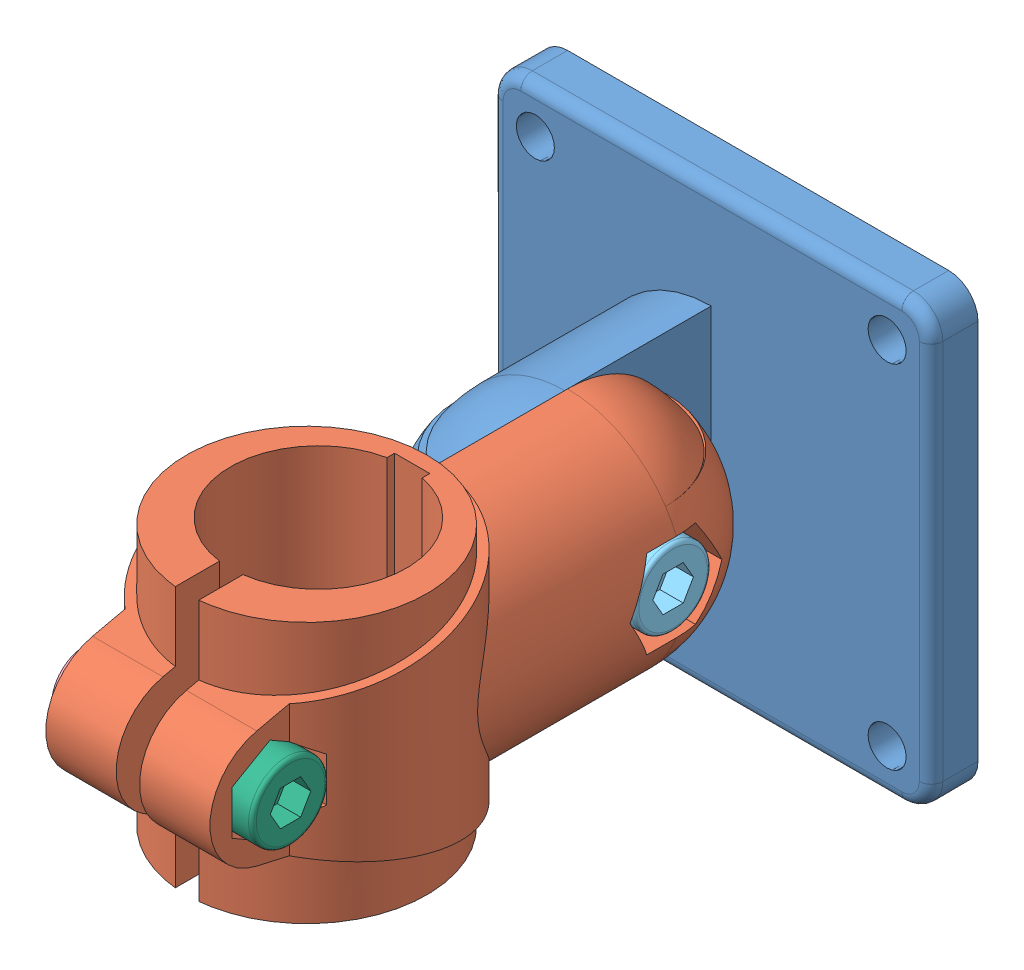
SolidWorks assembly TCC30-TP-PB-T-B.sldasm, configuration Default (file format 15000). Lengths in mm.
Overall size (75 75 107.5).
6 component instances, 6 part files, 0 mates.
Components (placement in the parent):
- TCC30-TP-PB-T-B_01-1: TCC30-TP-PB-T-B_01.sldprt [ﾃﾞﾌｫﾙﾄ] at (-1 0 0) x (0 0 1) z (1 0 0) size (54.5 75 75)
- TCC30-TP-PB-T-B_02-1: TCC30-TP-PB-T-B_02.sldprt [ﾃﾞﾌｫﾙﾄ] at (-1 0 57) x (0 0 -1) z (-1 0 0) size (95 44.5 44.85)
- TCC30-TP-PB-T-B_03-1: TCC30-TP-PB-T-B_03.sldprt [ﾃﾞﾌｫﾙﾄ] at (-9 0 33) x (0 0 -1) z (0 1 0) size (17.77 8.01 17.77)
- TCC30-TP-PB-T-B_04-1: TCC30-TP-PB-T-B_04.sldprt [ﾃﾞﾌｫﾙﾄ] at (-10.5 0 97.25) x (0 -1 0) z (0 0 -1) size (17.77 8.01 17.77)
- TCC30-TP-PB-T-B_05-1: TCC30-TP-PB-T-B_05.sldprt [ﾃﾞﾌｫﾙﾄ] at (9.5 0 33) x (0 -0.866025 -0.5) z (0 -0.5 0.866025) size (13 33 13)
- TCC30-TP-PB-T-B_06-1: TCC30-TP-PB-T-B_06.sldprt [ﾃﾞﾌｫﾙﾄ] at (8.5 0 97.25) x (0 0 1) z (0 1 0) size (13 33 13)
